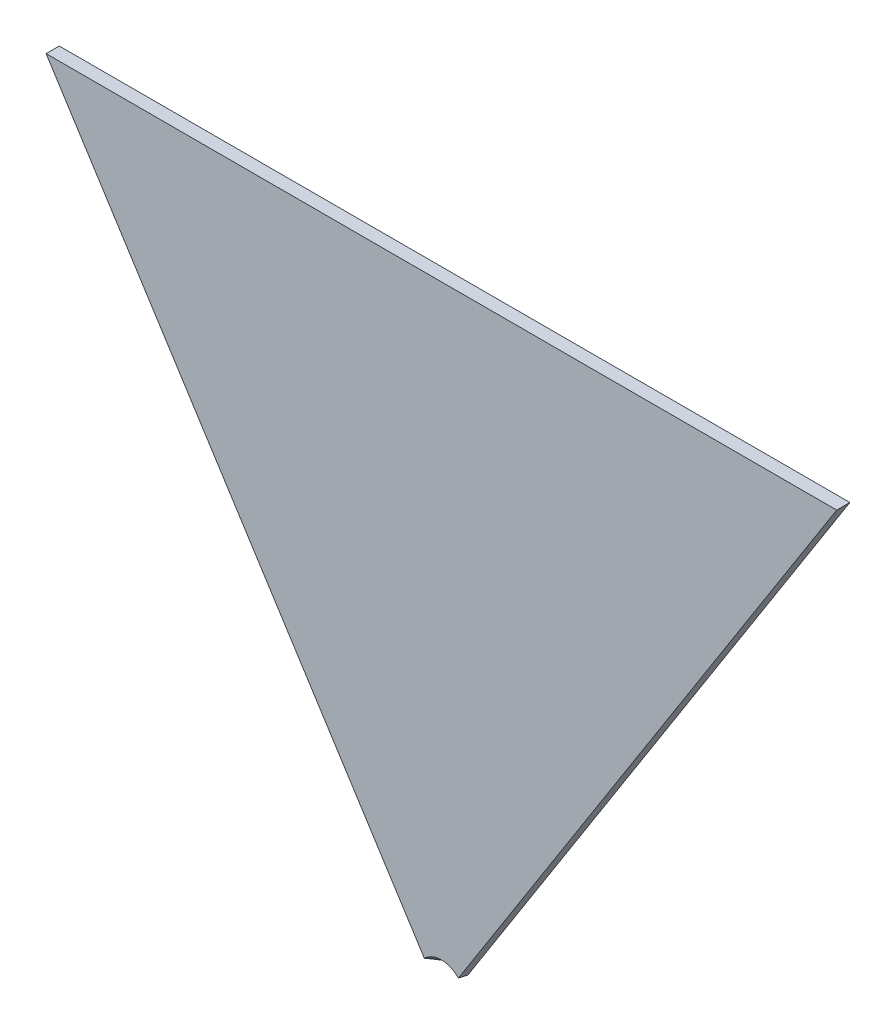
from build123d import *

# Parameters (mm, degrees)
AUFSATZ_LINEAR_AUSTRAGEN1_DEPTH = 15
SKIZZE2_R                       = 31.5
SCHNITT_LINEAR_AUSTRAGEN1_DEPTH = 1430.908486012


with BuildPart() as part:
    # Skizze1 → Aufsatz-Linear austragen1 (new body)
    with BuildSketch(Plane.XY):
        Polygon((-284.066242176, 9.706030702), (165.933757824, -697.353969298), (615.933757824, 9.706030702), align=None)
    extrude(amount=AUFSATZ_LINEAR_AUSTRAGEN1_DEPTH)

    # Skizze2 → Schnitt-Linear austragen1 (cut, through all)
    with BuildSketch(Plane(origin=(1026.69647759, -448.431407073, 341.539835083), x_dir=(0, 0.8143225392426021, -0.580412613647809), z_dir=(0, 0.5804126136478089, 0.8143225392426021))):
        with Locations((-13.175413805, 860.762719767)):
            Circle(SKIZZE2_R)
    extrude(amount=-SCHNITT_LINEAR_AUSTRAGEN1_DEPTH, mode=Mode.SUBTRACT)


solid = part.part
